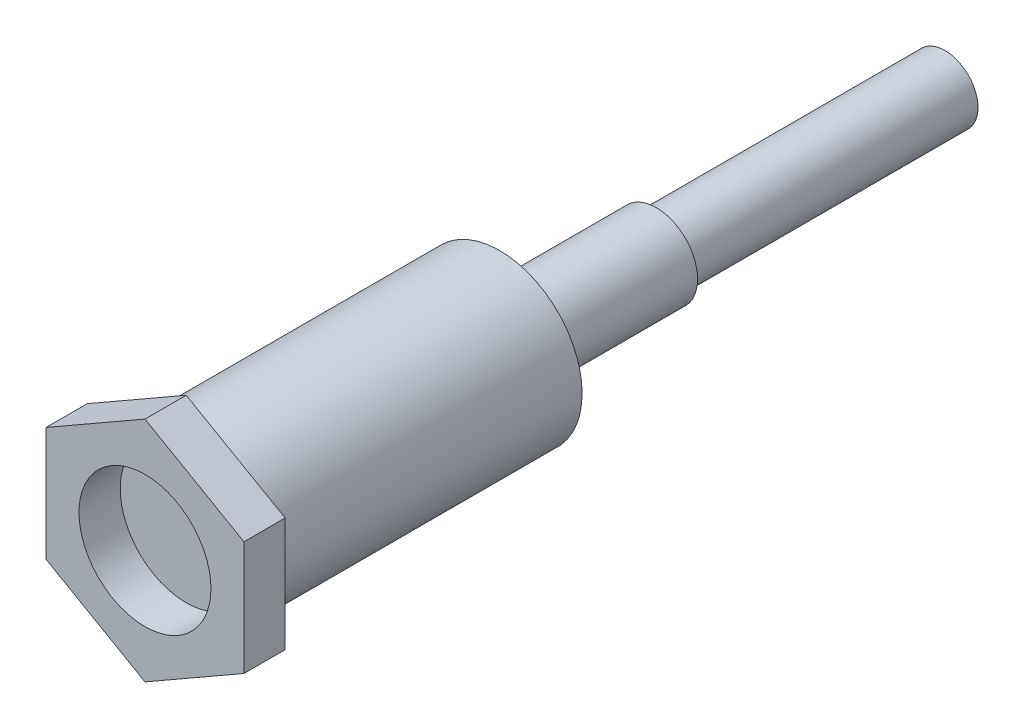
from build123d import *

# Parameters (mm, degrees)
ESQUISSE1_R      = 8
EXTRUSION1_DEPTH = 5


with BuildPart() as part:
    # Esquisse1 → Extrusion1 (new body)
    with BuildSketch(Plane.XY):
        Polygon((0, 13.8), (12, 6.916944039), (12, -6.916944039), (0, -13.8), (-12, -6.916944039), (-12, 6.916944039), align=None)
        Circle(ESQUISSE1_R, mode=Mode.SUBTRACT)
    extrude(amount=EXTRUSION1_DEPTH)

    # Esquisse2 → R_volution1 (revolve)
    with BuildSketch(Plane(origin=(0, 0, 0), x_dir=(1, 0, 0), z_dir=(0, 1, 0)), mode=Mode.PRIVATE) as r_volution1_sk:
        Polygon((0, 0), (-10, 0), (-10, 38), (-4, 38), (-4, 41), (-5, 41), (-5, 57), (-4.5, 57), (-4, 57.5), (-4, 92), (0, 92), align=None)
    revolve(r_volution1_sk.sketch.rotate(Axis((0, 0, 5), (0, 0, -1)), 180), axis=Axis((0, 0, 5), (0, 0, -1)))


solid = part.part
